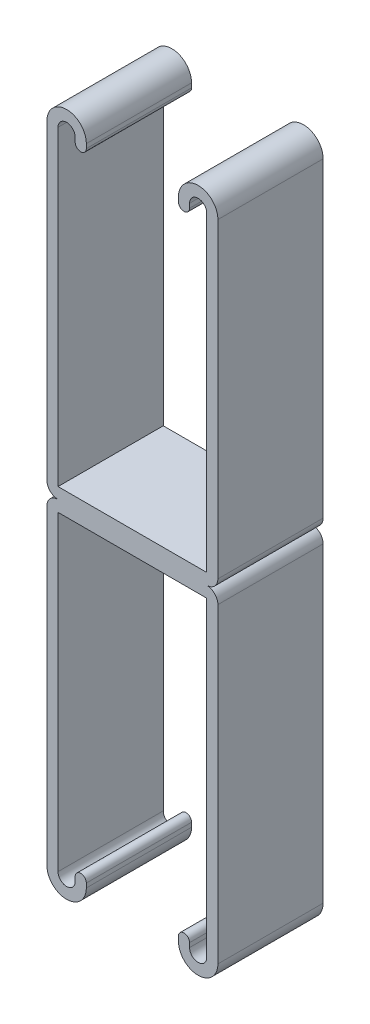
from build123d import *

# Parameters (mm, degrees)
BASE_EXTRUDE_DEPTH = 12.7


with BuildPart() as part:
    # Sketch1 → Base-Extrude (new, symmetric)
    with BuildSketch(Plane.XY):
        with BuildLine():
            Line((-20.6375, 77.7875), (-20.6375, 2.6924))
            ThreePointArc((-20.6375, 2.6924), (-19.848914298, 0.788585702), (-17.9451, 0))
            Line((-17.9451, 0), (17.9451, 0))
            ThreePointArc((17.9451, 0), (19.848914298, 0.788585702), (20.6375, 2.6924))
            Line((20.6375, 2.6924), (20.6375, 77.7875))
            ThreePointArc((20.6375, 77.7875), (15.875, 82.55), (11.1125, 77.7875))
            Line((11.1125, 77.7875), (11.1125, 76.75245))
            ThreePointArc((11.1125, 76.75245), (12.4587, 75.40625), (13.8049, 76.75245))
            Line((13.8049, 76.75245), (13.8049, 77.7875))
            ThreePointArc((13.8049, 77.7875), (15.875, 79.8576), (17.9451, 77.7875))
            Line((17.9451, 77.7875), (17.9451, 2.6924))
            Line((17.9451, 2.6924), (-17.9451, 2.6924))
            Line((-17.9451, 2.6924), (-17.9451, 77.7875))
            ThreePointArc((-17.9451, 77.7875), (-15.875, 79.8576), (-13.8049, 77.7875))
            Line((-13.8049, 77.7875), (-13.8049, 76.75245))
            ThreePointArc((-13.8049, 76.75245), (-12.4587, 75.40625), (-11.1125, 76.75245))
            Line((-11.1125, 76.75245), (-11.1125, 77.7875))
            ThreePointArc((-11.1125, 77.7875), (-15.875, 82.55), (-20.6375, 77.7875))
        make_face()
    base_extrude = extrude(amount=BASE_EXTRUDE_DEPTH, both=True)

    # Mirror1: Base-Extrude across plane
    add(base_extrude.mirror(Plane.ZX))


solid = part.part
